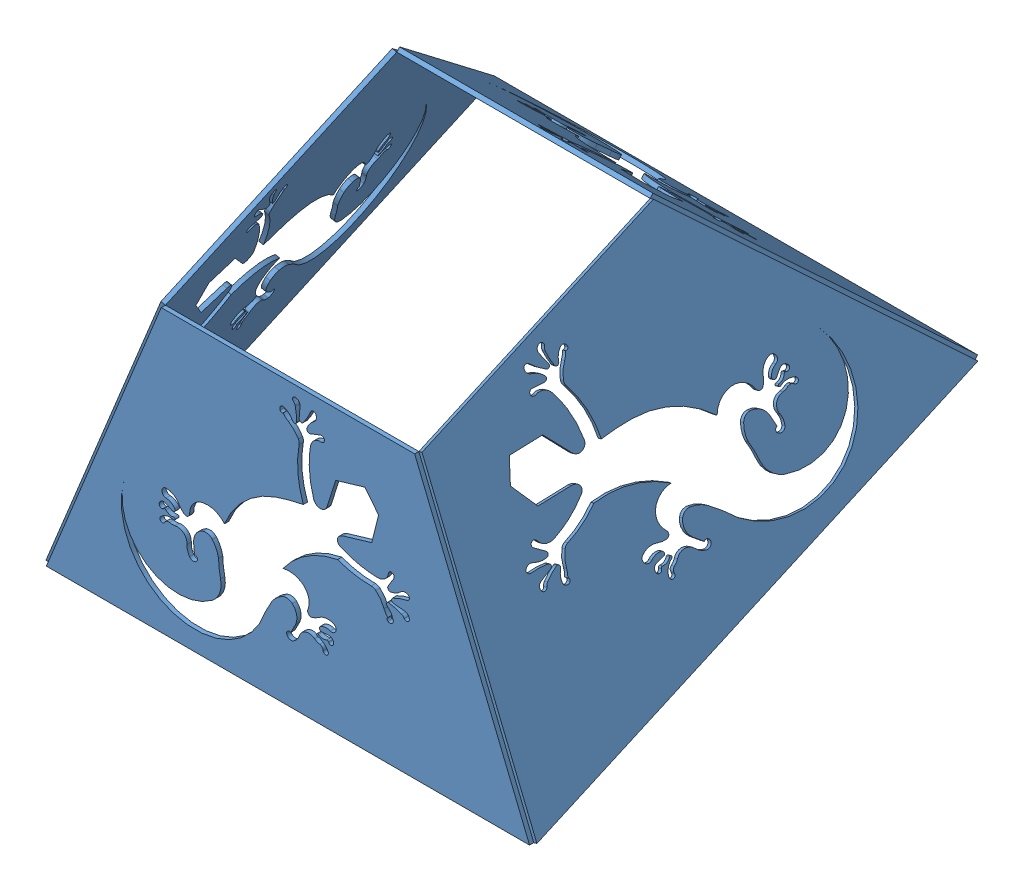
SolidWorks assembly tier3SLDASM.SLDASM, configuration Default (file format 8000). Lengths in mm.
Overall size (740.82 653.97 829.22).
4 component instances, 1 part files, 7 mates.
Components (placement in the parent):
- Base-3-tier-1: Base-3-tier.SLDPRT [Default] at (513.7761 -477.851 1015.4516) size (729.23 424.61 6.35)
- Base-3-tier-2: Base-3-tier.SLDPRT [Default] at (513.7761 178.619 -445.4892) x (1 0 0) z (0 -0.745566 0.666432) size (729.23 424.61 6.35)
- Base-3-tier-3: Base-3-tier.SLDPRT [Default] at (1278.6348 -165.4887 323.6336) x (0 -0.408392 0.912807) z (-0.912807 -0.372783 -0.166784) size (729.23 424.61 6.35)
- Base-3-tier-4: Base-3-tier.SLDPRT [Default] at (-323.0188 -167.8559 322.5746) x (0 -0.408392 0.912807) z (-0.912807 0.372783 0.166784) size (729.23 424.61 6.35)
Mates (geometry in assembly coordinates):
- Coincident1: coincident aligned: line of Base-3-tier-1 through (110.297 583.1777 1015.4516) axis (0.378079 0.925773 0); line of Base-3-tier-4 through (110.297 583.1777 1015.4516) axis (0.378079 0.925773 0)
- Coincident2: coincident: point of Base-3-tier-1; point of Base-3-tier-4
- Coincident3: coincident aligned: line of Base-3-tier-2 through (110.297 880.9877 349.8097) axis (0.378079 0.616965 0.690225); line of Base-3-tier-4 through (110.297 880.9877 349.8097) axis (0.378079 0.616965 0.690225)
- Coincident4: coincident: point of Base-3-tier-2; point of Base-3-tier-4
- Coincident5: coincident aligned: line of Base-3-tier-2 through (839.5226 880.9877 349.8097) axis (-0.378079 0.616965 0.690225); line of Base-3-tier-3 through (839.5226 880.9877 349.8097) axis (-0.378079 0.616965 0.690225)
- Coincident6: coincident aligned: line of Base-3-tier-1 through (839.5226 583.1777 1015.4516) axis (-0.378079 0.925773 0); line of Base-3-tier-3 through (839.5226 583.1777 1015.4516) axis (-0.378079 0.925773 0)
- Perpendicular1: perpendicular: line of Base-3-tier-1 through (110.297 583.1777 1015.4516) axis (1 0 0); line of Base-3-tier-3 through (839.5226 880.9877 349.8097) axis (0 -0.408392 0.912807)
